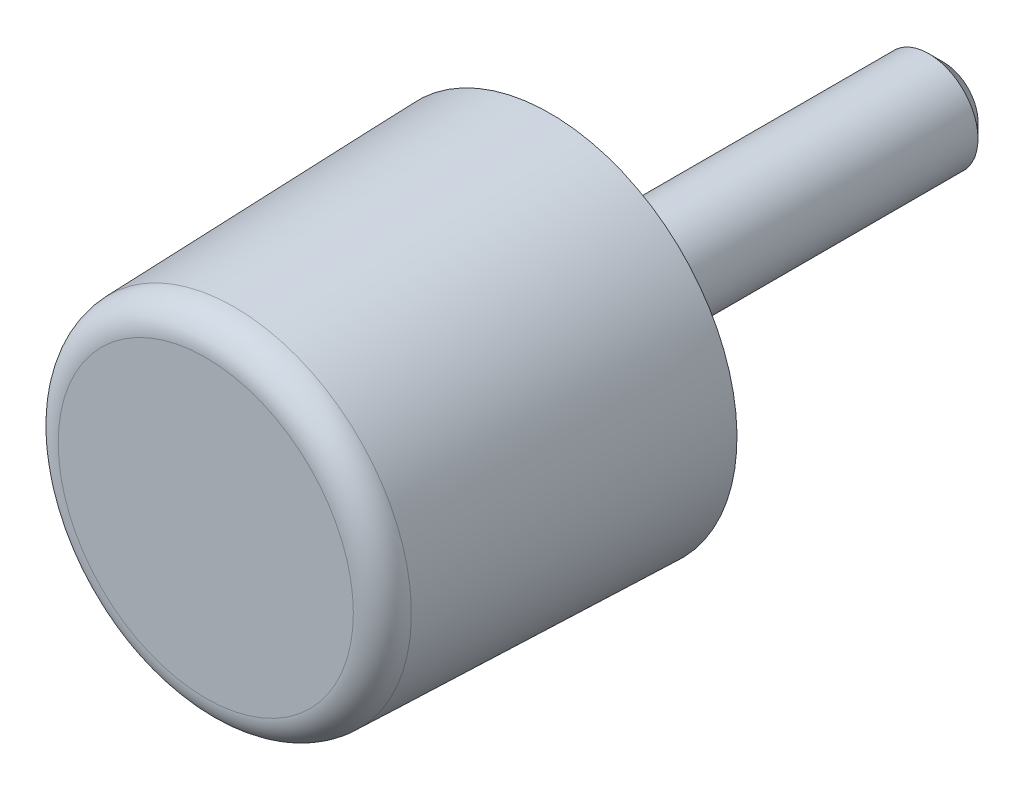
ISO-10303-21;
HEADER;
FILE_DESCRIPTION(('STEP AP214'),'2;1');
FILE_NAME('part.step','',(''),(''),'','','');
FILE_SCHEMA(('AUTOMOTIVE_DESIGN { 1 0 10303 214 1 1 1 1 }'));
ENDSEC;
DATA;
#1=APPLICATION_CONTEXT('core data for automotive mechanical design processes');
#2=APPLICATION_PROTOCOL_DEFINITION('international standard','automotive_design',2000,#1);
#3=PRODUCT_CONTEXT('',#1,'mechanical');
#4=PRODUCT('Part','Part','',(#3));
#5=PRODUCT_RELATED_PRODUCT_CATEGORY('part','',(#4));
#6=PRODUCT_DEFINITION_FORMATION('','',#4);
#7=PRODUCT_DEFINITION_CONTEXT('part definition',#1,'design');
#8=PRODUCT_DEFINITION('design','',#6,#7);
#9=PRODUCT_DEFINITION_SHAPE('','',#8);
#10=(LENGTH_UNIT() NAMED_UNIT(*) SI_UNIT(.MILLI.,.METRE.));
#11=(NAMED_UNIT(*) PLANE_ANGLE_UNIT() SI_UNIT($,.RADIAN.));
#12=(NAMED_UNIT(*) SI_UNIT($,.STERADIAN.) SOLID_ANGLE_UNIT());
#13=UNCERTAINTY_MEASURE_WITH_UNIT(LENGTH_MEASURE(1.E-05),#10,'distance_accuracy_value','');
#14=(GEOMETRIC_REPRESENTATION_CONTEXT(3) GLOBAL_UNCERTAINTY_ASSIGNED_CONTEXT((#13)) GLOBAL_UNIT_ASSIGNED_CONTEXT((#10,
#11,#12)) REPRESENTATION_CONTEXT('',''));
#15=CARTESIAN_POINT('',(0.,0.,0.));
#16=DIRECTION('',(0.,0.,1.));
#17=DIRECTION('',(1.,0.,0.));
#18=AXIS2_PLACEMENT_3D('',#15,#16,#17);
#19=CARTESIAN_POINT('',(0.,0.,35.));
#20=DIRECTION('',(0.,0.,1.));
#21=DIRECTION('',(0.,-1.,0.));
#22=AXIS2_PLACEMENT_3D('',#19,#20,#21);
#23=CYLINDRICAL_SURFACE('',#22,17.1);
#24=CARTESIAN_POINT('',(0.,0.,0.));
#25=DIRECTION('',(0.,0.,1.));
#26=DIRECTION('',(0.,-1.,0.));
#27=AXIS2_PLACEMENT_3D('',#24,#25,#26);
#28=CIRCLE('',#27,17.1);
#29=CARTESIAN_POINT('',(0.,-17.1,0.));
#30=VERTEX_POINT('',#29);
#31=EDGE_CURVE('E27',#30,#30,#28,.T.);
#32=ORIENTED_EDGE('',*,*,#31,.F.);
#33=EDGE_LOOP('',(#32));
#34=FACE_BOUND('',#33,.T.);
#35=CARTESIAN_POINT('',(0.,0.,0.0500000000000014));
#36=DIRECTION('',(0.,0.,1.));
#37=DIRECTION('',(0.,-1.,0.));
#38=AXIS2_PLACEMENT_3D('',#35,#36,#37);
#39=CIRCLE('',#38,17.1);
#40=CARTESIAN_POINT('',(0.,-17.1,0.0500000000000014));
#41=VERTEX_POINT('',#40);
#42=EDGE_CURVE('E44',#41,#41,#39,.T.);
#43=ORIENTED_EDGE('',*,*,#42,.T.);
#44=EDGE_LOOP('',(#43));
#45=FACE_BOUND('',#44,.T.);
#46=ADVANCED_FACE('F12',(#34,#45),#23,.F.);
#47=CARTESIAN_POINT('',(17.1,0.,0.));
#48=DIRECTION('',(0.,0.,1.));
#49=DIRECTION('',(0.,-1.,0.));
#50=AXIS2_PLACEMENT_3D('',#47,#48,#49);
#51=PLANE('',#50);
#52=CARTESIAN_POINT('',(0.,0.,0.));
#53=DIRECTION('',(0.,0.,1.));
#54=DIRECTION('',(0.,-1.,0.));
#55=AXIS2_PLACEMENT_3D('',#52,#53,#54);
#56=CIRCLE('',#55,19.);
#57=CARTESIAN_POINT('',(0.,-19.,0.));
#58=VERTEX_POINT('',#57);
#59=EDGE_CURVE('E32',#58,#58,#56,.T.);
#60=ORIENTED_EDGE('',*,*,#59,.F.);
#61=EDGE_LOOP('',(#60));
#62=FACE_BOUND('',#61,.T.);
#63=ORIENTED_EDGE('',*,*,#31,.T.);
#64=EDGE_LOOP('',(#63));
#65=FACE_BOUND('',#64,.T.);
#66=ADVANCED_FACE('F72',(#62,#65),#51,.F.);
#67=CARTESIAN_POINT('',(0.,0.,0.));
#68=DIRECTION('',(0.,0.,-1.));
#69=DIRECTION('',(0.,1.,0.));
#70=AXIS2_PLACEMENT_3D('',#67,#68,#69);
#71=CONICAL_SURFACE('',#70,19.,0.0311942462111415);
#72=CARTESIAN_POINT('',(0.,0.,32.0935675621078));
#73=DIRECTION('',(0.,0.,1.));
#74=DIRECTION('',(0.,-1.,0.));
#75=AXIS2_PLACEMENT_3D('',#72,#73,#74);
#76=CIRCLE('',#75,17.9985404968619);
#77=CARTESIAN_POINT('',(0.,-17.9985404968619,32.0935675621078));
#78=VERTEX_POINT('',#77);
#79=EDGE_CURVE('E35',#78,#78,#76,.T.);
#80=ORIENTED_EDGE('',*,*,#79,.F.);
#81=EDGE_LOOP('',(#80));
#82=FACE_BOUND('',#81,.T.);
#83=ORIENTED_EDGE('',*,*,#59,.T.);
#84=EDGE_LOOP('',(#83));
#85=FACE_BOUND('',#84,.T.);
#86=ADVANCED_FACE('F77',(#82,#85),#71,.T.);
#87=CARTESIAN_POINT('',(0.,0.,32.));
#88=DIRECTION('',(0.,0.,1.));
#89=DIRECTION('',(0.,-1.,0.));
#90=AXIS2_PLACEMENT_3D('',#87,#88,#89);
#91=TOROIDAL_SURFACE('',#90,15.,3.);
#92=ORIENTED_EDGE('',*,*,#79,.T.);
#93=EDGE_LOOP('',(#92));
#94=FACE_BOUND('',#93,.T.);
#95=CARTESIAN_POINT('',(0.,0.,35.));
#96=DIRECTION('',(0.,0.,1.));
#97=DIRECTION('',(0.,-1.,0.));
#98=AXIS2_PLACEMENT_3D('',#95,#96,#97);
#99=CIRCLE('',#98,15.);
#100=CARTESIAN_POINT('',(0.,-15.,35.));
#101=VERTEX_POINT('',#100);
#102=EDGE_CURVE('E38',#101,#101,#99,.T.);
#103=ORIENTED_EDGE('',*,*,#102,.F.);
#104=EDGE_LOOP('',(#103));
#105=FACE_BOUND('',#104,.T.);
#106=ADVANCED_FACE('F84',(#94,#105),#91,.T.);
#107=CARTESIAN_POINT('',(15.,0.,35.));
#108=DIRECTION('',(0.,0.,-1.));
#109=DIRECTION('',(0.,1.,0.));
#110=AXIS2_PLACEMENT_3D('',#107,#108,#109);
#111=PLANE('',#110);
#112=ORIENTED_EDGE('',*,*,#102,.T.);
#113=EDGE_LOOP('',(#112));
#114=FACE_BOUND('',#113,.T.);
#115=ADVANCED_FACE('F59',(#114),#111,.F.);
#116=CARTESIAN_POINT('',(0.,0.,0.));
#117=DIRECTION('',(0.,0.,1.));
#118=DIRECTION('',(0.,-1.,0.));
#119=AXIS2_PLACEMENT_3D('',#116,#117,#118);
#120=PLANE('',#119);
#121=CARTESIAN_POINT('',(0.,0.,0.));
#122=DIRECTION('',(0.,0.,1.));
#123=DIRECTION('',(0.,-1.,0.));
#124=AXIS2_PLACEMENT_3D('',#121,#122,#123);
#125=CIRCLE('',#124,17.05);
#126=CARTESIAN_POINT('',(0.,-17.05,0.));
#127=VERTEX_POINT('',#126);
#128=EDGE_CURVE('E41',#127,#127,#125,.T.);
#129=ORIENTED_EDGE('',*,*,#128,.F.);
#130=EDGE_LOOP('',(#129));
#131=FACE_BOUND('',#130,.T.);
#132=CARTESIAN_POINT('',(0.,0.,0.));
#133=DIRECTION('',(0.,0.,1.));
#134=DIRECTION('',(0.,-1.,0.));
#135=AXIS2_PLACEMENT_3D('',#132,#133,#134);
#136=CIRCLE('',#135,5.);
#137=CARTESIAN_POINT('',(0.,-5.,0.));
#138=VERTEX_POINT('',#137);
#139=EDGE_CURVE('E23',#138,#138,#136,.T.);
#140=ORIENTED_EDGE('',*,*,#139,.T.);
#141=EDGE_LOOP('',(#140));
#142=FACE_BOUND('',#141,.T.);
#143=ADVANCED_FACE('F53',(#131,#142),#120,.F.);
#144=CARTESIAN_POINT('',(0.,0.,0.));
#145=DIRECTION('',(0.,0.,1.));
#146=DIRECTION('',(0.,-1.,0.));
#147=AXIS2_PLACEMENT_3D('',#144,#145,#146);
#148=CONICAL_SURFACE('',#147,17.05,0.785398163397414);
#149=ORIENTED_EDGE('',*,*,#42,.F.);
#150=EDGE_LOOP('',(#149));
#151=FACE_BOUND('',#150,.T.);
#152=ORIENTED_EDGE('',*,*,#128,.T.);
#153=EDGE_LOOP('',(#152));
#154=FACE_BOUND('',#153,.T.);
#155=ADVANCED_FACE('F49',(#151,#154),#148,.T.);
#156=CARTESIAN_POINT('',(0.,0.,35.));
#157=DIRECTION('',(0.,0.,1.));
#158=DIRECTION('',(0.,-1.,0.));
#159=AXIS2_PLACEMENT_3D('',#156,#157,#158);
#160=CYLINDRICAL_SURFACE('',#159,5.);
#161=CARTESIAN_POINT('',(0.,0.,-38.5));
#162=DIRECTION('',(0.,0.,-1.));
#163=DIRECTION('',(0.,1.,0.));
#164=AXIS2_PLACEMENT_3D('',#161,#162,#163);
#165=CIRCLE('',#164,5.);
#166=CARTESIAN_POINT('',(0.,5.,-38.5));
#167=VERTEX_POINT('',#166);
#168=EDGE_CURVE('E8',#167,#167,#165,.F.);
#169=ORIENTED_EDGE('',*,*,#168,.T.);
#170=EDGE_LOOP('',(#169));
#171=FACE_BOUND('',#170,.T.);
#172=ORIENTED_EDGE('',*,*,#139,.F.);
#173=EDGE_LOOP('',(#172));
#174=FACE_BOUND('',#173,.T.);
#175=ADVANCED_FACE('F52',(#171,#174),#160,.T.);
#176=CARTESIAN_POINT('',(0.,0.,-40.));
#177=DIRECTION('',(0.,0.,-1.));
#178=DIRECTION('',(0.,1.,0.));
#179=AXIS2_PLACEMENT_3D('',#176,#177,#178);
#180=PLANE('',#179);
#181=CARTESIAN_POINT('',(0.,0.,-40.));
#182=DIRECTION('',(0.,0.,-1.));
#183=DIRECTION('',(0.,1.,0.));
#184=AXIS2_PLACEMENT_3D('',#181,#182,#183);
#185=CIRCLE('',#184,3.5);
#186=CARTESIAN_POINT('',(0.,3.5,-40.));
#187=VERTEX_POINT('',#186);
#188=EDGE_CURVE('E19',#187,#187,#185,.T.);
#189=ORIENTED_EDGE('',*,*,#188,.T.);
#190=EDGE_LOOP('',(#189));
#191=FACE_BOUND('',#190,.T.);
#192=ADVANCED_FACE('F64',(#191),#180,.T.);
#193=CARTESIAN_POINT('',(0.,0.,-40.));
#194=DIRECTION('',(0.,0.,1.));
#195=DIRECTION('',(0.,-1.,0.));
#196=AXIS2_PLACEMENT_3D('',#193,#194,#195);
#197=CONICAL_SURFACE('',#196,3.5,0.785398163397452);
#198=ORIENTED_EDGE('',*,*,#168,.F.);
#199=EDGE_LOOP('',(#198));
#200=FACE_BOUND('',#199,.T.);
#201=ORIENTED_EDGE('',*,*,#188,.F.);
#202=EDGE_LOOP('',(#201));
#203=FACE_BOUND('',#202,.T.);
#204=ADVANCED_FACE('F14',(#200,#203),#197,.T.);
#205=CLOSED_SHELL('',(#46,#66,#86,#106,#115,#143,#155,#175,#192,#204));
#206=MANIFOLD_SOLID_BREP('B1',#205);
#207=ADVANCED_BREP_SHAPE_REPRESENTATION('',(#18,#206),#14);
#208=SHAPE_DEFINITION_REPRESENTATION(#9,#207);
ENDSEC;
END-ISO-10303-21;
